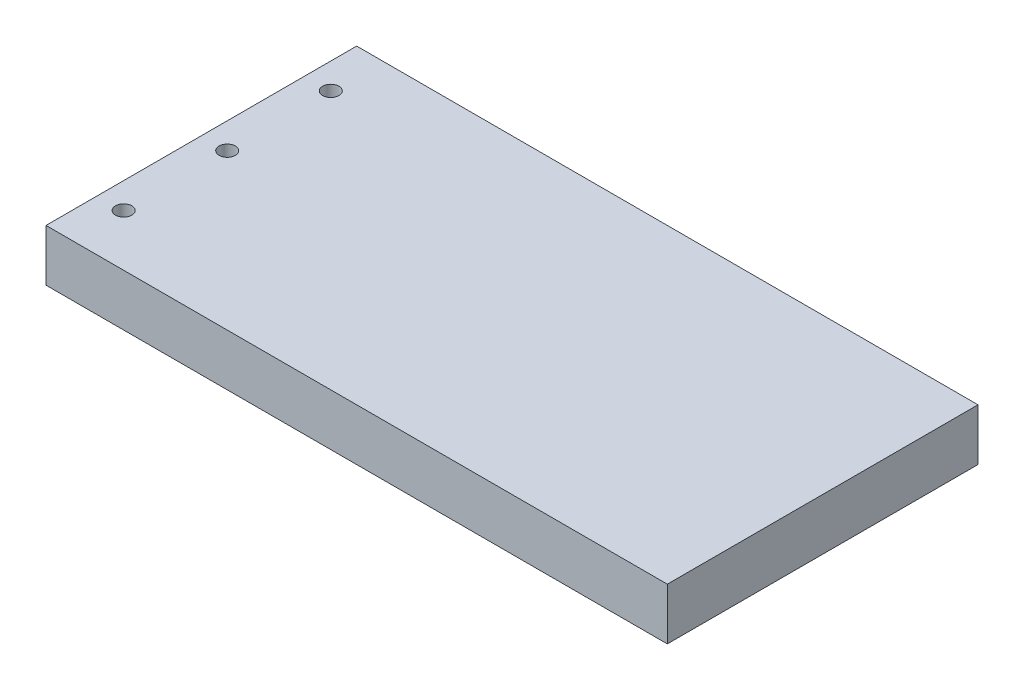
ISO-10303-21;
HEADER;
FILE_DESCRIPTION(('STEP AP214'),'2;1');
FILE_NAME('part.step','',(''),(''),'','','');
FILE_SCHEMA(('AUTOMOTIVE_DESIGN { 1 0 10303 214 1 1 1 1 }'));
ENDSEC;
DATA;
#1=APPLICATION_CONTEXT('core data for automotive mechanical design processes');
#2=APPLICATION_PROTOCOL_DEFINITION('international standard','automotive_design',2000,#1);
#3=PRODUCT_CONTEXT('',#1,'mechanical');
#4=PRODUCT('Part','Part','',(#3));
#5=PRODUCT_RELATED_PRODUCT_CATEGORY('part','',(#4));
#6=PRODUCT_DEFINITION_FORMATION('','',#4);
#7=PRODUCT_DEFINITION_CONTEXT('part definition',#1,'design');
#8=PRODUCT_DEFINITION('design','',#6,#7);
#9=PRODUCT_DEFINITION_SHAPE('','',#8);
#10=(LENGTH_UNIT() NAMED_UNIT(*) SI_UNIT(.MILLI.,.METRE.));
#11=(NAMED_UNIT(*) PLANE_ANGLE_UNIT() SI_UNIT($,.RADIAN.));
#12=(NAMED_UNIT(*) SI_UNIT($,.STERADIAN.) SOLID_ANGLE_UNIT());
#13=UNCERTAINTY_MEASURE_WITH_UNIT(LENGTH_MEASURE(1.E-05),#10,'distance_accuracy_value','');
#14=(GEOMETRIC_REPRESENTATION_CONTEXT(3) GLOBAL_UNCERTAINTY_ASSIGNED_CONTEXT((#13)) GLOBAL_UNIT_ASSIGNED_CONTEXT((#10,
#11,#12)) REPRESENTATION_CONTEXT('',''));
#15=CARTESIAN_POINT('',(0.,0.,0.));
#16=DIRECTION('',(0.,0.,1.));
#17=DIRECTION('',(1.,0.,0.));
#18=AXIS2_PLACEMENT_3D('',#15,#16,#17);
#19=CARTESIAN_POINT('',(-73.1554986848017,12.7,-31.2558135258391));
#20=DIRECTION('',(1.,0.,0.));
#21=DIRECTION('',(0.,0.,-1.));
#22=AXIS2_PLACEMENT_3D('',#19,#20,#21);
#23=PLANE('',#22);
#24=DIRECTION('',(0.,0.,1.));
#25=VECTOR('',#24,1.);
#26=CARTESIAN_POINT('',(-73.1554986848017,0.,-31.2558135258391));
#27=LINE('',#26,#25);
#28=CARTESIAN_POINT('',(-73.1554986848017,0.,-31.2558135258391));
#29=VERTEX_POINT('',#28);
#30=CARTESIAN_POINT('',(-73.1554986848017,0.,44.9441864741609));
#31=VERTEX_POINT('',#30);
#32=EDGE_CURVE('E96',#29,#31,#27,.T.);
#33=ORIENTED_EDGE('',*,*,#32,.T.);
#34=DIRECTION('',(0.,-1.,0.));
#35=VECTOR('',#34,1.);
#36=CARTESIAN_POINT('',(-73.1554986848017,12.7,44.9441864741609));
#37=LINE('',#36,#35);
#38=CARTESIAN_POINT('',(-73.1554986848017,12.7,44.9441864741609));
#39=VERTEX_POINT('',#38);
#40=EDGE_CURVE('E11',#39,#31,#37,.T.);
#41=ORIENTED_EDGE('',*,*,#40,.F.);
#42=DIRECTION('',(0.,0.,1.));
#43=VECTOR('',#42,1.);
#44=CARTESIAN_POINT('',(-73.1554986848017,12.7,-31.2558135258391));
#45=LINE('',#44,#43);
#46=CARTESIAN_POINT('',(-73.1554986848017,12.7,-31.2558135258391));
#47=VERTEX_POINT('',#46);
#48=EDGE_CURVE('E84',#47,#39,#45,.T.);
#49=ORIENTED_EDGE('',*,*,#48,.F.);
#50=DIRECTION('',(0.,-1.,0.));
#51=VECTOR('',#50,1.);
#52=CARTESIAN_POINT('',(-73.1554986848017,12.7,-31.2558135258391));
#53=LINE('',#52,#51);
#54=EDGE_CURVE('E92',#47,#29,#53,.T.);
#55=ORIENTED_EDGE('',*,*,#54,.T.);
#56=EDGE_LOOP('',(#33,#41,#49,#55));
#57=FACE_BOUND('',#56,.T.);
#58=ADVANCED_FACE('F33',(#57),#23,.F.);
#59=CARTESIAN_POINT('',(-73.1554986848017,12.7,44.9441864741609));
#60=DIRECTION('',(0.,0.,-1.));
#61=DIRECTION('',(-1.,0.,0.));
#62=AXIS2_PLACEMENT_3D('',#59,#60,#61);
#63=PLANE('',#62);
#64=DIRECTION('',(1.,0.,0.));
#65=VECTOR('',#64,1.);
#66=CARTESIAN_POINT('',(-73.1554986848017,0.,44.9441864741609));
#67=LINE('',#66,#65);
#68=CARTESIAN_POINT('',(79.2445013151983,0.,44.9441864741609));
#69=VERTEX_POINT('',#68);
#70=EDGE_CURVE('E88',#31,#69,#67,.T.);
#71=ORIENTED_EDGE('',*,*,#70,.T.);
#72=DIRECTION('',(0.,-1.,0.));
#73=VECTOR('',#72,1.);
#74=CARTESIAN_POINT('',(79.2445013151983,12.7,44.9441864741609));
#75=LINE('',#74,#73);
#76=CARTESIAN_POINT('',(79.2445013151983,12.7,44.9441864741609));
#77=VERTEX_POINT('',#76);
#78=EDGE_CURVE('E41',#77,#69,#75,.T.);
#79=ORIENTED_EDGE('',*,*,#78,.F.);
#80=DIRECTION('',(1.,0.,0.));
#81=VECTOR('',#80,1.);
#82=CARTESIAN_POINT('',(-73.1554986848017,12.7,44.9441864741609));
#83=LINE('',#82,#81);
#84=EDGE_CURVE('E79',#39,#77,#83,.T.);
#85=ORIENTED_EDGE('',*,*,#84,.F.);
#86=ORIENTED_EDGE('',*,*,#40,.T.);
#87=EDGE_LOOP('',(#71,#79,#85,#86));
#88=FACE_BOUND('',#87,.T.);
#89=ADVANCED_FACE('F87',(#88),#63,.F.);
#90=CARTESIAN_POINT('',(79.2445013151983,12.7,-31.2558135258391));
#91=DIRECTION('',(-1.,0.,0.));
#92=DIRECTION('',(0.,0.,1.));
#93=AXIS2_PLACEMENT_3D('',#90,#91,#92);
#94=PLANE('',#93);
#95=DIRECTION('',(0.,0.,-1.));
#96=VECTOR('',#95,1.);
#97=CARTESIAN_POINT('',(79.2445013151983,0.,-31.2558135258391));
#98=LINE('',#97,#96);
#99=CARTESIAN_POINT('',(79.2445013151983,0.,-31.2558135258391));
#100=VERTEX_POINT('',#99);
#101=EDGE_CURVE('E66',#69,#100,#98,.T.);
#102=ORIENTED_EDGE('',*,*,#101,.T.);
#103=DIRECTION('',(0.,-1.,0.));
#104=VECTOR('',#103,1.);
#105=CARTESIAN_POINT('',(79.2445013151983,12.7,-31.2558135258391));
#106=LINE('',#105,#104);
#107=CARTESIAN_POINT('',(79.2445013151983,12.7,-31.2558135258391));
#108=VERTEX_POINT('',#107);
#109=EDGE_CURVE('E89',#108,#100,#106,.T.);
#110=ORIENTED_EDGE('',*,*,#109,.F.);
#111=DIRECTION('',(0.,0.,-1.));
#112=VECTOR('',#111,1.);
#113=CARTESIAN_POINT('',(79.2445013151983,12.7,-31.2558135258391));
#114=LINE('',#113,#112);
#115=EDGE_CURVE('E82',#77,#108,#114,.T.);
#116=ORIENTED_EDGE('',*,*,#115,.F.);
#117=ORIENTED_EDGE('',*,*,#78,.T.);
#118=EDGE_LOOP('',(#102,#110,#116,#117));
#119=FACE_BOUND('',#118,.T.);
#120=ADVANCED_FACE('F90',(#119),#94,.F.);
#121=CARTESIAN_POINT('',(-73.1554986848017,12.7,-31.2558135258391));
#122=DIRECTION('',(0.,0.,1.));
#123=DIRECTION('',(1.,0.,0.));
#124=AXIS2_PLACEMENT_3D('',#121,#122,#123);
#125=PLANE('',#124);
#126=DIRECTION('',(-1.,0.,0.));
#127=VECTOR('',#126,1.);
#128=CARTESIAN_POINT('',(-73.1554986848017,0.,-31.2558135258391));
#129=LINE('',#128,#127);
#130=EDGE_CURVE('E72',#100,#29,#129,.T.);
#131=ORIENTED_EDGE('',*,*,#130,.T.);
#132=ORIENTED_EDGE('',*,*,#54,.F.);
#133=DIRECTION('',(-1.,0.,0.));
#134=VECTOR('',#133,1.);
#135=CARTESIAN_POINT('',(-73.1554986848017,12.7,-31.2558135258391));
#136=LINE('',#135,#134);
#137=EDGE_CURVE('E49',#108,#47,#136,.T.);
#138=ORIENTED_EDGE('',*,*,#137,.F.);
#139=ORIENTED_EDGE('',*,*,#109,.T.);
#140=EDGE_LOOP('',(#131,#132,#138,#139));
#141=FACE_BOUND('',#140,.T.);
#142=ADVANCED_FACE('F104',(#141),#125,.F.);
#143=CARTESIAN_POINT('',(-73.1554986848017,12.7,44.9441864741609));
#144=DIRECTION('',(0.,1.,0.));
#145=DIRECTION('',(0.,0.,1.));
#146=AXIS2_PLACEMENT_3D('',#143,#144,#145);
#147=PLANE('',#146);
#148=CARTESIAN_POINT('',(-66.8054986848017,12.7,32.2441864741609));
#149=DIRECTION('',(0.,1.,0.));
#150=DIRECTION('',(0.,0.,1.));
#151=AXIS2_PLACEMENT_3D('',#148,#149,#150);
#152=CIRCLE('',#151,2.);
#153=CARTESIAN_POINT('',(-66.8054986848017,12.7,34.2441864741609));
#154=VERTEX_POINT('',#153);
#155=EDGE_CURVE('E122',#154,#154,#152,.T.);
#156=ORIENTED_EDGE('',*,*,#155,.F.);
#157=EDGE_LOOP('',(#156));
#158=FACE_BOUND('',#157,.T.);
#159=CARTESIAN_POINT('',(-66.8054986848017,12.7,6.84418647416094));
#160=DIRECTION('',(0.,1.,0.));
#161=DIRECTION('',(0.,0.,1.));
#162=AXIS2_PLACEMENT_3D('',#159,#160,#161);
#163=CIRCLE('',#162,2.);
#164=CARTESIAN_POINT('',(-66.8054986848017,12.7,8.84418647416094));
#165=VERTEX_POINT('',#164);
#166=EDGE_CURVE('E116',#165,#165,#163,.T.);
#167=ORIENTED_EDGE('',*,*,#166,.F.);
#168=EDGE_LOOP('',(#167));
#169=FACE_BOUND('',#168,.T.);
#170=CARTESIAN_POINT('',(-66.8054986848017,12.7,-18.5558135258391));
#171=DIRECTION('',(0.,1.,0.));
#172=DIRECTION('',(0.,0.,1.));
#173=AXIS2_PLACEMENT_3D('',#170,#171,#172);
#174=CIRCLE('',#173,2.);
#175=CARTESIAN_POINT('',(-66.8054986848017,12.7,-16.5558135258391));
#176=VERTEX_POINT('',#175);
#177=EDGE_CURVE('E110',#176,#176,#174,.T.);
#178=ORIENTED_EDGE('',*,*,#177,.F.);
#179=EDGE_LOOP('',(#178));
#180=FACE_BOUND('',#179,.T.);
#181=ORIENTED_EDGE('',*,*,#48,.T.);
#182=ORIENTED_EDGE('',*,*,#84,.T.);
#183=ORIENTED_EDGE('',*,*,#115,.T.);
#184=ORIENTED_EDGE('',*,*,#137,.T.);
#185=EDGE_LOOP('',(#181,#182,#183,#184));
#186=FACE_BOUND('',#185,.T.);
#187=ADVANCED_FACE('F80',(#158,#169,#180,#186),#147,.T.);
#188=CARTESIAN_POINT('',(-73.1554986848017,0.,44.9441864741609));
#189=DIRECTION('',(0.,1.,0.));
#190=DIRECTION('',(0.,0.,1.));
#191=AXIS2_PLACEMENT_3D('',#188,#189,#190);
#192=PLANE('',#191);
#193=CARTESIAN_POINT('',(-66.8054986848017,0.,32.2441864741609));
#194=DIRECTION('',(0.,1.,0.));
#195=DIRECTION('',(0.,0.,1.));
#196=AXIS2_PLACEMENT_3D('',#193,#194,#195);
#197=CIRCLE('',#196,2.);
#198=CARTESIAN_POINT('',(-66.8054986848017,0.,34.2441864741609));
#199=VERTEX_POINT('',#198);
#200=EDGE_CURVE('E119',#199,#199,#197,.T.);
#201=ORIENTED_EDGE('',*,*,#200,.T.);
#202=EDGE_LOOP('',(#201));
#203=FACE_BOUND('',#202,.T.);
#204=CARTESIAN_POINT('',(-66.8054986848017,0.,6.84418647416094));
#205=DIRECTION('',(0.,1.,0.));
#206=DIRECTION('',(0.,0.,1.));
#207=AXIS2_PLACEMENT_3D('',#204,#205,#206);
#208=CIRCLE('',#207,2.);
#209=CARTESIAN_POINT('',(-66.8054986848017,0.,8.84418647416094));
#210=VERTEX_POINT('',#209);
#211=EDGE_CURVE('E113',#210,#210,#208,.T.);
#212=ORIENTED_EDGE('',*,*,#211,.T.);
#213=EDGE_LOOP('',(#212));
#214=FACE_BOUND('',#213,.T.);
#215=CARTESIAN_POINT('',(-66.8054986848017,0.,-18.5558135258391));
#216=DIRECTION('',(0.,1.,0.));
#217=DIRECTION('',(0.,0.,1.));
#218=AXIS2_PLACEMENT_3D('',#215,#216,#217);
#219=CIRCLE('',#218,2.);
#220=CARTESIAN_POINT('',(-66.8054986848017,0.,-16.5558135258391));
#221=VERTEX_POINT('',#220);
#222=EDGE_CURVE('E99',#221,#221,#219,.T.);
#223=ORIENTED_EDGE('',*,*,#222,.T.);
#224=EDGE_LOOP('',(#223));
#225=FACE_BOUND('',#224,.T.);
#226=ORIENTED_EDGE('',*,*,#32,.F.);
#227=ORIENTED_EDGE('',*,*,#130,.F.);
#228=ORIENTED_EDGE('',*,*,#101,.F.);
#229=ORIENTED_EDGE('',*,*,#70,.F.);
#230=EDGE_LOOP('',(#226,#227,#228,#229));
#231=FACE_BOUND('',#230,.T.);
#232=ADVANCED_FACE('F107',(#203,#214,#225,#231),#192,.F.);
#233=CARTESIAN_POINT('',(-66.8054986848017,0.,-18.5558135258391));
#234=DIRECTION('',(0.,1.,0.));
#235=DIRECTION('',(0.,0.,1.));
#236=AXIS2_PLACEMENT_3D('',#233,#234,#235);
#237=CYLINDRICAL_SURFACE('',#236,2.);
#238=ORIENTED_EDGE('',*,*,#222,.F.);
#239=EDGE_LOOP('',(#238));
#240=FACE_BOUND('',#239,.T.);
#241=ORIENTED_EDGE('',*,*,#177,.T.);
#242=EDGE_LOOP('',(#241));
#243=FACE_BOUND('',#242,.T.);
#244=ADVANCED_FACE('F144',(#240,#243),#237,.F.);
#245=CARTESIAN_POINT('',(-66.8054986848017,0.,6.84418647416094));
#246=DIRECTION('',(0.,1.,0.));
#247=DIRECTION('',(0.,0.,1.));
#248=AXIS2_PLACEMENT_3D('',#245,#246,#247);
#249=CYLINDRICAL_SURFACE('',#248,2.);
#250=ORIENTED_EDGE('',*,*,#211,.F.);
#251=EDGE_LOOP('',(#250));
#252=FACE_BOUND('',#251,.T.);
#253=ORIENTED_EDGE('',*,*,#166,.T.);
#254=EDGE_LOOP('',(#253));
#255=FACE_BOUND('',#254,.T.);
#256=ADVANCED_FACE('F133',(#252,#255),#249,.F.);
#257=CARTESIAN_POINT('',(-66.8054986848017,0.,32.2441864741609));
#258=DIRECTION('',(0.,1.,0.));
#259=DIRECTION('',(0.,0.,1.));
#260=AXIS2_PLACEMENT_3D('',#257,#258,#259);
#261=CYLINDRICAL_SURFACE('',#260,2.);
#262=ORIENTED_EDGE('',*,*,#200,.F.);
#263=EDGE_LOOP('',(#262));
#264=FACE_BOUND('',#263,.T.);
#265=ORIENTED_EDGE('',*,*,#155,.T.);
#266=EDGE_LOOP('',(#265));
#267=FACE_BOUND('',#266,.T.);
#268=ADVANCED_FACE('F130',(#264,#267),#261,.F.);
#269=CLOSED_SHELL('',(#58,#89,#120,#142,#187,#232,#244,#256,#268));
#270=MANIFOLD_SOLID_BREP('B2',#269);
#271=ADVANCED_BREP_SHAPE_REPRESENTATION('',(#18,#270),#14);
#272=SHAPE_DEFINITION_REPRESENTATION(#9,#271);
ENDSEC;
END-ISO-10303-21;
